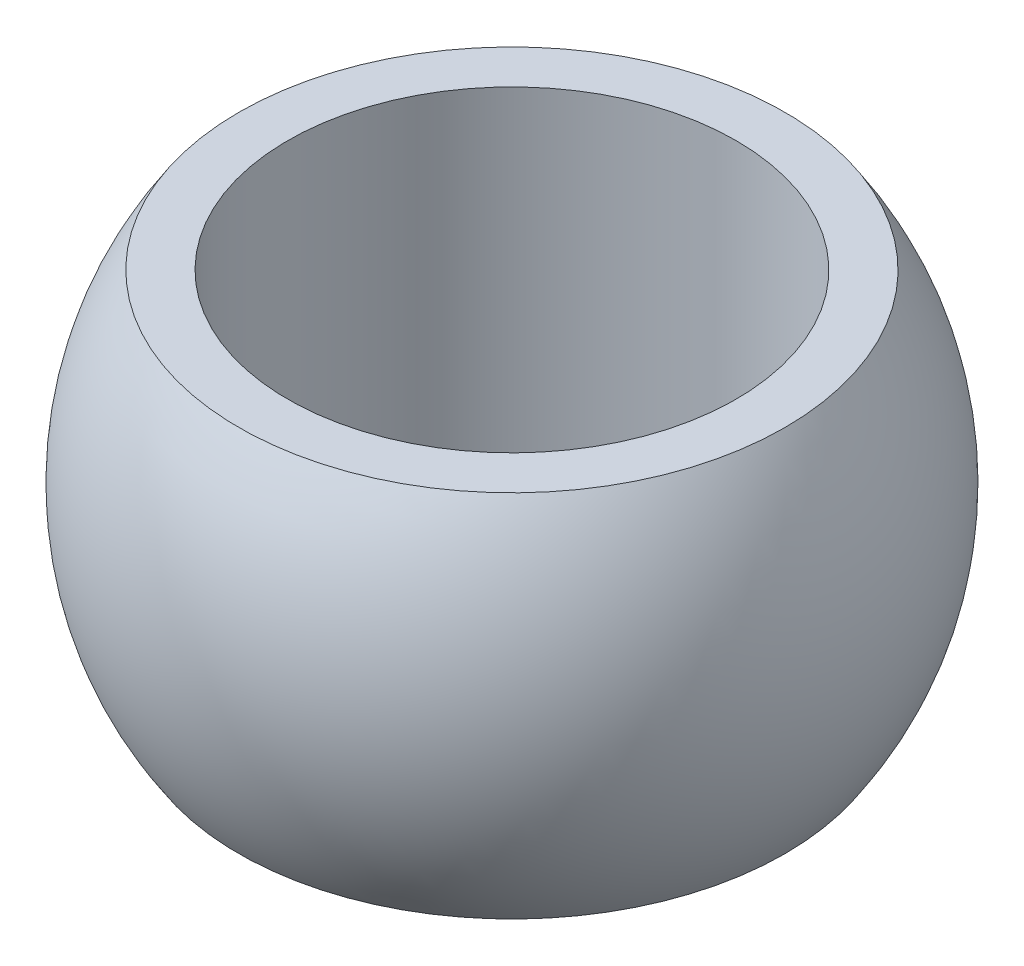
ISO-10303-21;
HEADER;
FILE_DESCRIPTION(('STEP AP214'),'2;1');
FILE_NAME('part.step','',(''),(''),'','','');
FILE_SCHEMA(('AUTOMOTIVE_DESIGN { 1 0 10303 214 1 1 1 1 }'));
ENDSEC;
DATA;
#1=APPLICATION_CONTEXT('core data for automotive mechanical design processes');
#2=APPLICATION_PROTOCOL_DEFINITION('international standard','automotive_design',2000,#1);
#3=PRODUCT_CONTEXT('',#1,'mechanical');
#4=PRODUCT('Part','Part','',(#3));
#5=PRODUCT_RELATED_PRODUCT_CATEGORY('part','',(#4));
#6=PRODUCT_DEFINITION_FORMATION('','',#4);
#7=PRODUCT_DEFINITION_CONTEXT('part definition',#1,'design');
#8=PRODUCT_DEFINITION('design','',#6,#7);
#9=PRODUCT_DEFINITION_SHAPE('','',#8);
#10=(LENGTH_UNIT() NAMED_UNIT(*) SI_UNIT(.MILLI.,.METRE.));
#11=(NAMED_UNIT(*) PLANE_ANGLE_UNIT() SI_UNIT($,.RADIAN.));
#12=(NAMED_UNIT(*) SI_UNIT($,.STERADIAN.) SOLID_ANGLE_UNIT());
#13=UNCERTAINTY_MEASURE_WITH_UNIT(LENGTH_MEASURE(1.E-05),#10,'distance_accuracy_value','');
#14=(GEOMETRIC_REPRESENTATION_CONTEXT(3) GLOBAL_UNCERTAINTY_ASSIGNED_CONTEXT((#13)) GLOBAL_UNIT_ASSIGNED_CONTEXT((#10,
#11,#12)) REPRESENTATION_CONTEXT('',''));
#15=CARTESIAN_POINT('',(0.,0.,0.));
#16=DIRECTION('',(0.,0.,1.));
#17=DIRECTION('',(1.,0.,0.));
#18=AXIS2_PLACEMENT_3D('',#15,#16,#17);
#19=CARTESIAN_POINT('',(0.,-15.339775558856,0.));
#20=DIRECTION('',(0.,-1.,0.));
#21=DIRECTION('',(0.,0.,-1.));
#22=AXIS2_PLACEMENT_3D('',#19,#20,#21);
#23=CYLINDRICAL_SURFACE('',#22,8.5);
#24=CARTESIAN_POINT('',(0.,-7.,0.));
#25=DIRECTION('',(0.,-1.,0.));
#26=DIRECTION('',(0.,0.,-1.));
#27=AXIS2_PLACEMENT_3D('',#24,#25,#26);
#28=CIRCLE('',#27,8.5);
#29=CARTESIAN_POINT('',(0.,-7.,-8.5));
#30=VERTEX_POINT('',#29);
#31=EDGE_CURVE('E10',#30,#30,#28,.T.);
#32=ORIENTED_EDGE('',*,*,#31,.T.);
#33=EDGE_LOOP('',(#32));
#34=FACE_BOUND('',#33,.T.);
#35=CARTESIAN_POINT('',(0.,7.,0.));
#36=DIRECTION('',(0.,-1.,0.));
#37=DIRECTION('',(0.,0.,-1.));
#38=AXIS2_PLACEMENT_3D('',#35,#36,#37);
#39=CIRCLE('',#38,8.5);
#40=CARTESIAN_POINT('',(0.,7.,-8.5));
#41=VERTEX_POINT('',#40);
#42=EDGE_CURVE('E47',#41,#41,#39,.T.);
#43=ORIENTED_EDGE('',*,*,#42,.F.);
#44=EDGE_LOOP('',(#43));
#45=FACE_BOUND('',#44,.T.);
#46=ADVANCED_FACE('F33',(#34,#45),#23,.F.);
#47=CARTESIAN_POINT('',(8.5,-7.,0.));
#48=DIRECTION('',(0.,-1.,0.));
#49=DIRECTION('',(0.,0.,-1.));
#50=AXIS2_PLACEMENT_3D('',#47,#48,#49);
#51=PLANE('',#50);
#52=CARTESIAN_POINT('',(0.,-7.,0.));
#53=DIRECTION('',(0.,-1.,0.));
#54=DIRECTION('',(0.,0.,-1.));
#55=AXIS2_PLACEMENT_3D('',#52,#53,#54);
#56=CIRCLE('',#55,10.356157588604);
#57=CARTESIAN_POINT('',(10.356157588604,-7.,0.));
#58=VERTEX_POINT('',#57);
#59=EDGE_CURVE('E39',#58,#58,#56,.T.);
#60=ORIENTED_EDGE('',*,*,#59,.T.);
#61=EDGE_LOOP('',(#60));
#62=FACE_BOUND('',#61,.T.);
#63=ORIENTED_EDGE('',*,*,#31,.F.);
#64=EDGE_LOOP('',(#63));
#65=FACE_BOUND('',#64,.T.);
#66=ADVANCED_FACE('F57',(#62,#65),#51,.T.);
#67=CARTESIAN_POINT('',(0.,0.,0.));
#68=DIRECTION('',(0.,-1.,0.));
#69=DIRECTION('',(1.,0.,0.));
#70=AXIS2_PLACEMENT_3D('',#67,#68,#69);
#71=SPHERICAL_SURFACE('',#70,12.5);
#72=CARTESIAN_POINT('',(0.,7.00000000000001,0.));
#73=DIRECTION('',(0.,-1.,0.));
#74=DIRECTION('',(0.,0.,-1.));
#75=AXIS2_PLACEMENT_3D('',#72,#73,#74);
#76=CIRCLE('',#75,10.356157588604);
#77=CARTESIAN_POINT('',(10.356157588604,7.00000000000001,0.));
#78=VERTEX_POINT('',#77);
#79=EDGE_CURVE('E43',#78,#78,#76,.T.);
#80=CARTESIAN_POINT('',(10.356157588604,7.00000000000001,0.));
#81=CARTESIAN_POINT('',(10.4428400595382,6.87176006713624,0.));
#82=CARTESIAN_POINT('',(10.5271381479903,6.74190857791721,0.));
#83=CARTESIAN_POINT('',(10.6908545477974,6.47916497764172,0.));
#84=CARTESIAN_POINT('',(10.7702728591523,6.34627286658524,0.));
#85=CARTESIAN_POINT('',(10.9241186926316,6.07763051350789,0.));
#86=CARTESIAN_POINT('',(10.998546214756,5.94188027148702,0.));
#87=CARTESIAN_POINT('',(11.1423081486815,5.66770921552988,0.));
#88=CARTESIAN_POINT('',(11.2116425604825,5.52928840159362,0.));
#89=CARTESIAN_POINT('',(11.3451224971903,5.24996714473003,0.));
#90=CARTESIAN_POINT('',(11.409268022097,5.1090667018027,0.));
#91=CARTESIAN_POINT('',(11.5322816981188,4.82498063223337,0.));
#92=CARTESIAN_POINT('',(11.5911498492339,4.68179500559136,0.));
#93=CARTESIAN_POINT('',(11.7035275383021,4.39333614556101,0.));
#94=CARTESIAN_POINT('',(11.7570370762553,4.24806291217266,0.));
#95=CARTESIAN_POINT('',(11.8586237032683,3.95562930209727,0.));
#96=CARTESIAN_POINT('',(11.9067007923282,3.80846892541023,0.));
#97=CARTESIAN_POINT('',(11.9973561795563,3.51246409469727,0.));
#98=CARTESIAN_POINT('',(12.0399344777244,3.36361964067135,0.));
#99=CARTESIAN_POINT('',(12.1195335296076,3.06445204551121,0.));
#100=CARTESIAN_POINT('',(12.1565542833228,2.914128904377,0.));
#101=CARTESIAN_POINT('',(12.2249871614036,2.61221136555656,0.));
#102=CARTESIAN_POINT('',(12.2563992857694,2.46061696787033,0.));
#103=CARTESIAN_POINT('',(12.3135715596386,2.15636610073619,0.));
#104=CARTESIAN_POINT('',(12.3393317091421,2.00370963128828,0.));
#105=CARTESIAN_POINT('',(12.3851644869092,1.69754527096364,0.));
#106=CARTESIAN_POINT('',(12.4052371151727,1.54403738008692,0.));
#107=CARTESIAN_POINT('',(12.4396671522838,1.23638200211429,0.));
#108=CARTESIAN_POINT('',(12.4540245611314,1.08223451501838,0.));
#109=CARTESIAN_POINT('',(12.4770043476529,0.773512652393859,0.));
#110=CARTESIAN_POINT('',(12.4856267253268,0.618938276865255,0.));
#111=CARTESIAN_POINT('',(12.4971245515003,0.309575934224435,0.));
#112=CARTESIAN_POINT('',(12.5,0.15478796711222,0.));
#113=CARTESIAN_POINT('',(12.5,-0.154787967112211,0.));
#114=CARTESIAN_POINT('',(12.4971245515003,-0.309575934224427,0.));
#115=CARTESIAN_POINT('',(12.4856267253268,-0.618938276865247,0.));
#116=CARTESIAN_POINT('',(12.4770043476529,-0.773512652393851,0.));
#117=CARTESIAN_POINT('',(12.4540245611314,-1.08223451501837,0.));
#118=CARTESIAN_POINT('',(12.4396671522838,-1.23638200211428,0.));
#119=CARTESIAN_POINT('',(12.4052371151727,-1.54403738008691,0.));
#120=CARTESIAN_POINT('',(12.3851644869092,-1.69754527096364,0.));
#121=CARTESIAN_POINT('',(12.3393317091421,-2.00370963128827,0.));
#122=CARTESIAN_POINT('',(12.3135715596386,-2.15636610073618,0.));
#123=CARTESIAN_POINT('',(12.2563992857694,-2.46061696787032,0.));
#124=CARTESIAN_POINT('',(12.2249871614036,-2.61221136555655,0.));
#125=CARTESIAN_POINT('',(12.1565542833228,-2.914128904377,0.));
#126=CARTESIAN_POINT('',(12.1195335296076,-3.06445204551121,0.));
#127=CARTESIAN_POINT('',(12.0399344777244,-3.36361964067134,0.));
#128=CARTESIAN_POINT('',(11.9973561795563,-3.51246409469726,0.));
#129=CARTESIAN_POINT('',(11.9067007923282,-3.80846892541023,0.));
#130=CARTESIAN_POINT('',(11.8586237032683,-3.95562930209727,0.));
#131=CARTESIAN_POINT('',(11.7570370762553,-4.24806291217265,0.));
#132=CARTESIAN_POINT('',(11.7035275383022,-4.393336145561,0.));
#133=CARTESIAN_POINT('',(11.5911498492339,-4.68179500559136,0.));
#134=CARTESIAN_POINT('',(11.5322816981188,-4.82498063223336,0.));
#135=CARTESIAN_POINT('',(11.409268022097,-5.10906670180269,0.));
#136=CARTESIAN_POINT('',(11.3451224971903,-5.24996714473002,0.));
#137=CARTESIAN_POINT('',(11.2116425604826,-5.52928840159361,0.));
#138=CARTESIAN_POINT('',(11.1423081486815,-5.66770921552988,0.));
#139=CARTESIAN_POINT('',(10.998546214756,-5.94188027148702,0.));
#140=CARTESIAN_POINT('',(10.9241186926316,-6.07763051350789,0.));
#141=CARTESIAN_POINT('',(10.7702728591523,-6.34627286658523,0.));
#142=CARTESIAN_POINT('',(10.6908545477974,-6.47916497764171,0.));
#143=CARTESIAN_POINT('',(10.5271381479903,-6.74190857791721,0.));
#144=CARTESIAN_POINT('',(10.4428400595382,-6.87176006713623,0.));
#145=CARTESIAN_POINT('',(10.356157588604,-7.,0.));
#146=B_SPLINE_CURVE_WITH_KNOTS('',3,(#80,#81,#82,#83,#84,#85,#86,#87,#88,#89,#90,#91,#92,#93,
#94,#95,#96,#97,#98,#99,#100,#101,#102,#103,#104,#105,#106,#107,#108,#109,#110,#111,#112,#113,
#114,#115,#116,#117,#118,#119,#120,#121,#122,#123,#124,#125,#126,#127,#128,#129,#130,#131,#132,
#133,#134,#135,#136,#137,#138,#139,#140,#141,#142,#143,#144,#145),.UNSPECIFIED.,.F.,.F.,(4,2,2,
2,2,2,2,2,2,2,2,2,2,2,2,2,2,2,2,2,2,2,2,2,2,2,2,2,2,2,2,2,4),(0.,0.464337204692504,
0.928674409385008,1.39301161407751,1.85734881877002,2.32168602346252,2.78602322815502,
3.25036043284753,3.71469763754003,4.17903484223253,4.64337204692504,5.10770925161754,
5.57204645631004,6.03638366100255,6.50072086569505,6.96505807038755,7.42939527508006,
7.89373247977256,8.35806968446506,8.82240688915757,9.28674409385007,9.75108129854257,
10.2154185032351,10.6797557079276,11.1440929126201,11.6084301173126,12.0727673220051,
12.5371045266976,13.0014417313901,13.4657789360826,13.9301161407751,14.3944533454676,
14.8587905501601),.UNSPECIFIED.);
#147=EDGE_CURVE('BSEAM61',#78,#58,#146,.T.);
#148=ORIENTED_EDGE('',*,*,#79,.T.);
#149=ORIENTED_EDGE('',*,*,#59,.F.);
#150=ORIENTED_EDGE('',*,*,#147,.T.);
#151=ORIENTED_EDGE('',*,*,#147,.F.);
#152=EDGE_LOOP('',(#148,#150,#149,#151));
#153=FACE_BOUND('',#152,.T.);
#154=ADVANCED_FACE('F61',(#153),#71,.T.);
#155=CARTESIAN_POINT('',(8.5,7.,0.));
#156=DIRECTION('',(0.,1.,0.));
#157=DIRECTION('',(0.,0.,1.));
#158=AXIS2_PLACEMENT_3D('',#155,#156,#157);
#159=PLANE('',#158);
#160=ORIENTED_EDGE('',*,*,#42,.T.);
#161=EDGE_LOOP('',(#160));
#162=FACE_BOUND('',#161,.T.);
#163=ORIENTED_EDGE('',*,*,#79,.F.);
#164=EDGE_LOOP('',(#163));
#165=FACE_BOUND('',#164,.T.);
#166=ADVANCED_FACE('F53',(#162,#165),#159,.T.);
#167=CLOSED_SHELL('',(#46,#66,#154,#166));
#168=MANIFOLD_SOLID_BREP('B2',#167);
#169=ADVANCED_BREP_SHAPE_REPRESENTATION('',(#18,#168),#14);
#170=SHAPE_DEFINITION_REPRESENTATION(#9,#169);
ENDSEC;
END-ISO-10303-21;
